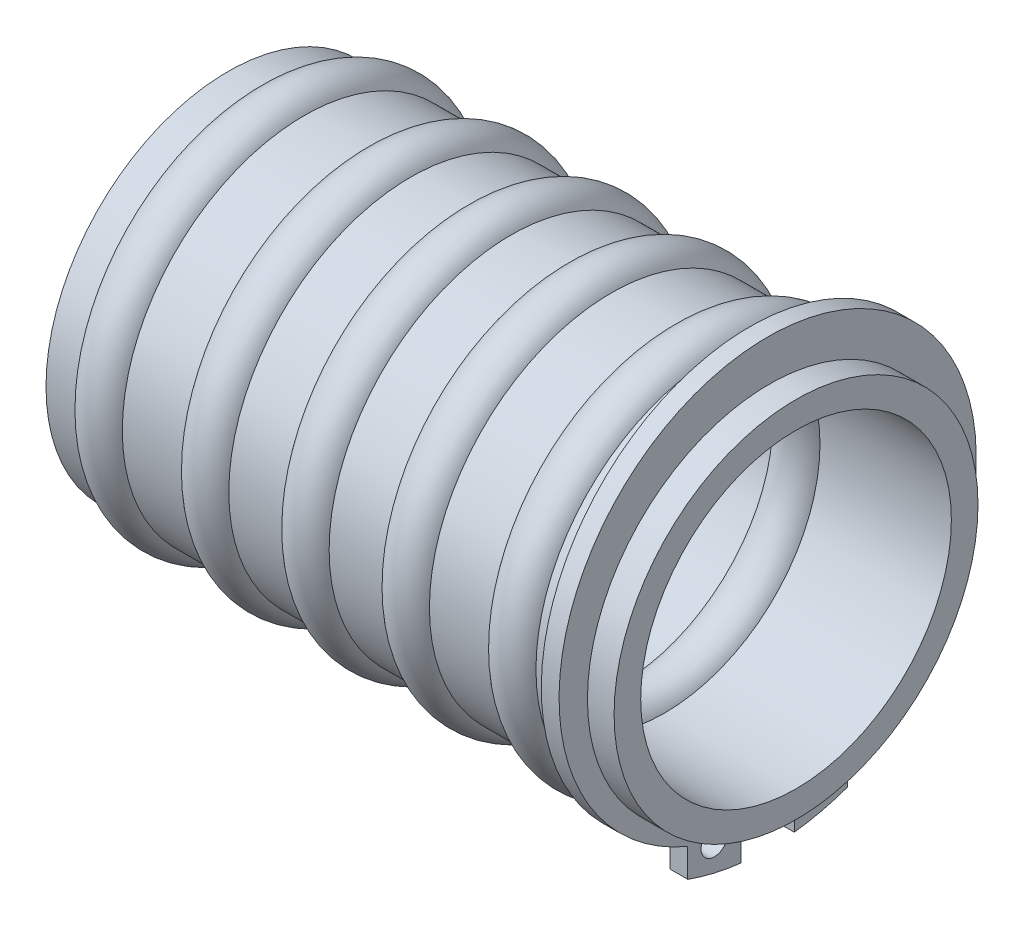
from build123d import *

# Parameters (mm, degrees)
ESQUISSE2_R      = 1.5
ESQUISSE3_R      = 0.75
EXTRUSION1_DEPTH = 1


with BuildPart() as part:
    # Esquisse1 → R_volution1 (revolve)
    with BuildSketch(Plane.XY, mode=Mode.PRIVATE) as r_volution1_sk:
        with BuildLine():
            Line((0, 8.75), (4.700961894, 8.75))
            ThreePointArc((4.700961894, 8.75), (6, 8), (7.299038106, 8.75))
            Line((7.299038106, 8.75), (22.000961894, 8.75))
            ThreePointArc((22.000961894, 8.75), (23.3, 8), (24.599038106, 8.75))
            Line((24.599038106, 8.75), (32, 8.75))
            Line((32, 8.75), (32, 10.25))
            Line((32, 10.25), (30.5, 10.25))
            Line((30.5, 10.25), (30.5, 9.5))
            Line((30.5, 9.5), (29.3, 9.5))
            Line((29.3, 9.5), (29.3, 10.25))
            Line((29.3, 10.25), (27.599038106, 10.25))
            ThreePointArc((27.599038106, 10.25), (26.3, 11), (25.000961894, 10.25))
            Line((25.000961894, 10.25), (21.599038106, 10.25))
            ThreePointArc((21.599038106, 10.25), (20.3, 11), (19.000961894, 10.25))
            Line((19.000961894, 10.25), (10.299038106, 10.25))
            ThreePointArc((10.299038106, 10.25), (9, 11), (7.700961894, 10.25))
            Line((7.700961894, 10.25), (4.299038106, 10.25))
            ThreePointArc((4.299038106, 10.25), (3, 11), (1.700961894, 10.25))
            Line((1.700961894, 10.25), (0, 10.25))
            Line((0, 10.25), (0, 8.75))
        make_face()
    revolve(r_volution1_sk.sketch.rotate(Axis((32, 0, 0), (-1, 0, 0)), 270), axis=Axis((32, 0, 0), (-1, 0, 0)))

    # Esquisse2 → R_volution2 (revolve)
    with BuildSketch(Plane.XY, mode=Mode.PRIVATE) as r_volution2_sk:
        with Locations((14.65, 9.5)):
            Circle(ESQUISSE2_R)
    revolve(r_volution2_sk.sketch.rotate(Axis((50, 0, 0), (-1, 0, 0)), 270), axis=Axis((50, 0, 0), (-1, 0, 0)))

    # Esquisse3 → Extrusion1 (add)
    with BuildSketch(Plane(origin=(29.4, 0, 0), x_dir=(0, 0, -1), z_dir=(1, 0, 0))):
        with BuildLine():
            Line((-4.5, -10.104146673), (-4.5, -11.712443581))
            ThreePointArc((-4.5, -11.712443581), (-3.020485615, -12.151130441), (-1.5, -12.414820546))
            Line((-1.5, -12.414820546), (-1.5, -9.178235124))
            ThreePointArc((-1.5, -9.178235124), (0, 9.3), (1.5, -9.178235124))
            Line((1.5, -9.178235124), (1.5, -12.414820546))
            ThreePointArc((1.5, -12.414820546), (3.020485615, -12.151130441), (4.5, -11.712443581))
            Line((4.5, -11.712443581), (4.5, -10.104146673))
            ThreePointArc((4.5, -10.104146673), (0, 12.5), (-4.5, -10.104146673))
        make_face()
        with Locations((3, -10.610567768)):
            Circle(ESQUISSE3_R, mode=Mode.SUBTRACT)
        with Locations((-3, -10.610567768)):
            Circle(ESQUISSE3_R, mode=Mode.SUBTRACT)
    extrude(amount=EXTRUSION1_DEPTH)


solid = part.part
